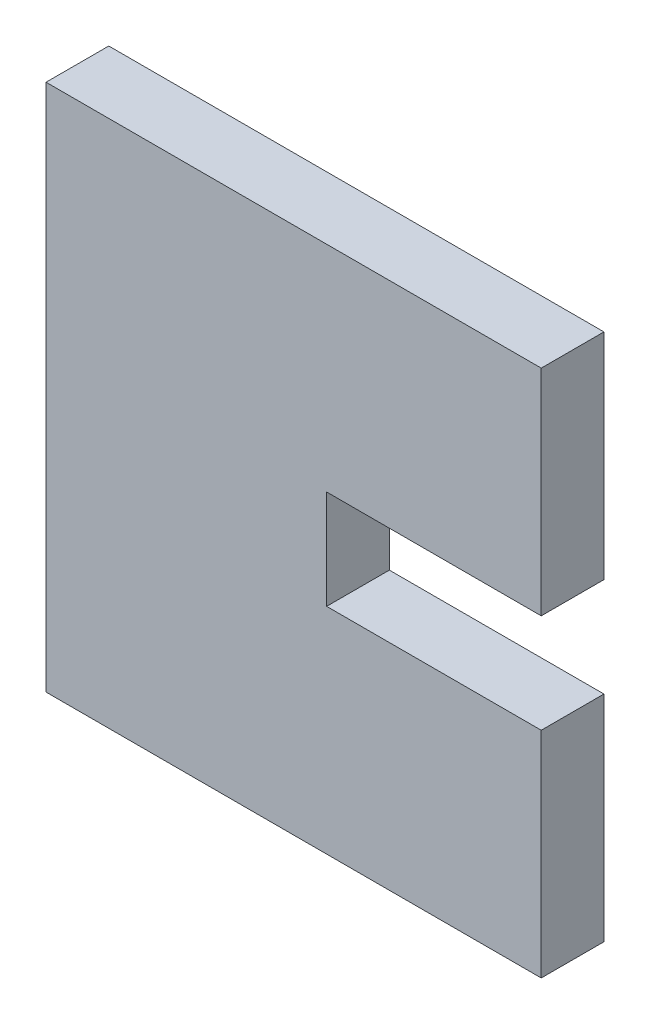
ISO-10303-21;
HEADER;
FILE_DESCRIPTION(('STEP AP214'),'2;1');
FILE_NAME('part.step','',(''),(''),'','','');
FILE_SCHEMA(('AUTOMOTIVE_DESIGN { 1 0 10303 214 1 1 1 1 }'));
ENDSEC;
DATA;
#1=APPLICATION_CONTEXT('core data for automotive mechanical design processes');
#2=APPLICATION_PROTOCOL_DEFINITION('international standard','automotive_design',2000,#1);
#3=PRODUCT_CONTEXT('',#1,'mechanical');
#4=PRODUCT('Part','Part','',(#3));
#5=PRODUCT_RELATED_PRODUCT_CATEGORY('part','',(#4));
#6=PRODUCT_DEFINITION_FORMATION('','',#4);
#7=PRODUCT_DEFINITION_CONTEXT('part definition',#1,'design');
#8=PRODUCT_DEFINITION('design','',#6,#7);
#9=PRODUCT_DEFINITION_SHAPE('','',#8);
#10=(LENGTH_UNIT() NAMED_UNIT(*) SI_UNIT(.MILLI.,.METRE.));
#11=(NAMED_UNIT(*) PLANE_ANGLE_UNIT() SI_UNIT($,.RADIAN.));
#12=(NAMED_UNIT(*) SI_UNIT($,.STERADIAN.) SOLID_ANGLE_UNIT());
#13=UNCERTAINTY_MEASURE_WITH_UNIT(LENGTH_MEASURE(1.E-05),#10,'distance_accuracy_value','');
#14=(GEOMETRIC_REPRESENTATION_CONTEXT(3) GLOBAL_UNCERTAINTY_ASSIGNED_CONTEXT((#13)) GLOBAL_UNIT_ASSIGNED_CONTEXT((#10,
#11,#12)) REPRESENTATION_CONTEXT('',''));
#15=CARTESIAN_POINT('',(0.,0.,0.));
#16=DIRECTION('',(0.,0.,1.));
#17=DIRECTION('',(1.,0.,0.));
#18=AXIS2_PLACEMENT_3D('',#15,#16,#17);
#19=CARTESIAN_POINT('',(-32.,16.,4.));
#20=DIRECTION('',(0.,1.,0.));
#21=DIRECTION('',(0.,0.,1.));
#22=AXIS2_PLACEMENT_3D('',#19,#20,#21);
#23=PLANE('',#22);
#24=DIRECTION('',(0.,0.,-1.));
#25=VECTOR('',#24,1.);
#26=CARTESIAN_POINT('',(-2.,16.,4.));
#27=LINE('',#26,#25);
#28=CARTESIAN_POINT('',(-2.,16.,4.));
#29=VERTEX_POINT('',#28);
#30=CARTESIAN_POINT('',(-2.,16.,0.200000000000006));
#31=VERTEX_POINT('',#30);
#32=EDGE_CURVE('E130',#29,#31,#27,.T.);
#33=ORIENTED_EDGE('',*,*,#32,.T.);
#34=DIRECTION('',(-1.,0.,0.));
#35=VECTOR('',#34,1.);
#36=CARTESIAN_POINT('',(-32.,16.,0.200000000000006));
#37=LINE('',#36,#35);
#38=CARTESIAN_POINT('',(-32.,16.,0.200000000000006));
#39=VERTEX_POINT('',#38);
#40=EDGE_CURVE('E11',#31,#39,#37,.T.);
#41=ORIENTED_EDGE('',*,*,#40,.T.);
#42=DIRECTION('',(0.,0.,-1.));
#43=VECTOR('',#42,1.);
#44=CARTESIAN_POINT('',(-32.,16.,4.));
#45=LINE('',#44,#43);
#46=CARTESIAN_POINT('',(-32.,16.,4.));
#47=VERTEX_POINT('',#46);
#48=EDGE_CURVE('E152',#47,#39,#45,.T.);
#49=ORIENTED_EDGE('',*,*,#48,.F.);
#50=DIRECTION('',(1.,0.,0.));
#51=VECTOR('',#50,1.);
#52=CARTESIAN_POINT('',(-32.,16.,4.));
#53=LINE('',#52,#51);
#54=EDGE_CURVE('E145',#47,#29,#53,.T.);
#55=ORIENTED_EDGE('',*,*,#54,.T.);
#56=EDGE_LOOP('',(#33,#41,#49,#55));
#57=FACE_BOUND('',#56,.T.);
#58=ADVANCED_FACE('F41',(#57),#23,.T.);
#59=CARTESIAN_POINT('',(-32.,-16.,4.));
#60=DIRECTION('',(-1.,0.,0.));
#61=DIRECTION('',(0.,0.,1.));
#62=AXIS2_PLACEMENT_3D('',#59,#60,#61);
#63=PLANE('',#62);
#64=ORIENTED_EDGE('',*,*,#48,.T.);
#65=DIRECTION('',(0.,-1.,0.));
#66=VECTOR('',#65,1.);
#67=CARTESIAN_POINT('',(-32.,-16.,0.200000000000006));
#68=LINE('',#67,#66);
#69=CARTESIAN_POINT('',(-32.,-16.,0.200000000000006));
#70=VERTEX_POINT('',#69);
#71=EDGE_CURVE('E201',#39,#70,#68,.T.);
#72=ORIENTED_EDGE('',*,*,#71,.T.);
#73=DIRECTION('',(0.,0.,-1.));
#74=VECTOR('',#73,1.);
#75=CARTESIAN_POINT('',(-32.,-16.,4.));
#76=LINE('',#75,#74);
#77=CARTESIAN_POINT('',(-32.,-16.,4.));
#78=VERTEX_POINT('',#77);
#79=EDGE_CURVE('E170',#78,#70,#76,.T.);
#80=ORIENTED_EDGE('',*,*,#79,.F.);
#81=DIRECTION('',(0.,1.,0.));
#82=VECTOR('',#81,1.);
#83=CARTESIAN_POINT('',(-32.,-16.,4.));
#84=LINE('',#83,#82);
#85=EDGE_CURVE('E138',#78,#47,#84,.T.);
#86=ORIENTED_EDGE('',*,*,#85,.T.);
#87=EDGE_LOOP('',(#64,#72,#80,#86));
#88=FACE_BOUND('',#87,.T.);
#89=ADVANCED_FACE('F253',(#88),#63,.T.);
#90=CARTESIAN_POINT('',(-32.,-16.,4.));
#91=DIRECTION('',(0.,1.,0.));
#92=DIRECTION('',(0.,0.,1.));
#93=AXIS2_PLACEMENT_3D('',#90,#91,#92);
#94=PLANE('',#93);
#95=ORIENTED_EDGE('',*,*,#79,.T.);
#96=DIRECTION('',(1.,0.,0.));
#97=VECTOR('',#96,1.);
#98=CARTESIAN_POINT('',(-2.,-16.,0.200000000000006));
#99=LINE('',#98,#97);
#100=CARTESIAN_POINT('',(-2.,-16.,0.200000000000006));
#101=VERTEX_POINT('',#100);
#102=EDGE_CURVE('E204',#70,#101,#99,.T.);
#103=ORIENTED_EDGE('',*,*,#102,.T.);
#104=DIRECTION('',(0.,0.,-1.));
#105=VECTOR('',#104,1.);
#106=CARTESIAN_POINT('',(-2.,-16.,4.));
#107=LINE('',#106,#105);
#108=CARTESIAN_POINT('',(-2.,-16.,4.));
#109=VERTEX_POINT('',#108);
#110=EDGE_CURVE('E173',#109,#101,#107,.T.);
#111=ORIENTED_EDGE('',*,*,#110,.F.);
#112=DIRECTION('',(1.,0.,0.));
#113=VECTOR('',#112,1.);
#114=CARTESIAN_POINT('',(-32.,-16.,4.));
#115=LINE('',#114,#113);
#116=EDGE_CURVE('E165',#78,#109,#115,.T.);
#117=ORIENTED_EDGE('',*,*,#116,.F.);
#118=EDGE_LOOP('',(#95,#103,#111,#117));
#119=FACE_BOUND('',#118,.T.);
#120=ADVANCED_FACE('F265',(#119),#94,.F.);
#121=CARTESIAN_POINT('',(-2.,-16.,4.));
#122=DIRECTION('',(-1.,0.,0.));
#123=DIRECTION('',(0.,-1.,0.));
#124=AXIS2_PLACEMENT_3D('',#121,#122,#123);
#125=PLANE('',#124);
#126=ORIENTED_EDGE('',*,*,#110,.T.);
#127=DIRECTION('',(0.,1.,0.));
#128=VECTOR('',#127,1.);
#129=CARTESIAN_POINT('',(-2.,-3.,0.200000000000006));
#130=LINE('',#129,#128);
#131=CARTESIAN_POINT('',(-2.,-3.,0.200000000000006));
#132=VERTEX_POINT('',#131);
#133=EDGE_CURVE('E206',#101,#132,#130,.T.);
#134=ORIENTED_EDGE('',*,*,#133,.T.);
#135=DIRECTION('',(0.,0.,-1.));
#136=VECTOR('',#135,1.);
#137=CARTESIAN_POINT('',(-2.,-3.,4.));
#138=LINE('',#137,#136);
#139=CARTESIAN_POINT('',(-2.,-3.,4.));
#140=VERTEX_POINT('',#139);
#141=EDGE_CURVE('E176',#140,#132,#138,.T.);
#142=ORIENTED_EDGE('',*,*,#141,.F.);
#143=DIRECTION('',(0.,1.,0.));
#144=VECTOR('',#143,1.);
#145=CARTESIAN_POINT('',(-2.,-16.,4.));
#146=LINE('',#145,#144);
#147=EDGE_CURVE('E163',#109,#140,#146,.T.);
#148=ORIENTED_EDGE('',*,*,#147,.F.);
#149=EDGE_LOOP('',(#126,#134,#142,#148));
#150=FACE_BOUND('',#149,.T.);
#151=ADVANCED_FACE('F270',(#150),#125,.F.);
#152=CARTESIAN_POINT('',(-2.,-3.,4.));
#153=DIRECTION('',(0.,-1.,0.));
#154=DIRECTION('',(1.,0.,0.));
#155=AXIS2_PLACEMENT_3D('',#152,#153,#154);
#156=PLANE('',#155);
#157=ORIENTED_EDGE('',*,*,#141,.T.);
#158=DIRECTION('',(-1.,0.,0.));
#159=VECTOR('',#158,1.);
#160=CARTESIAN_POINT('',(-15.,-3.,0.200000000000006));
#161=LINE('',#160,#159);
#162=CARTESIAN_POINT('',(-15.,-3.,0.200000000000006));
#163=VERTEX_POINT('',#162);
#164=EDGE_CURVE('E208',#132,#163,#161,.T.);
#165=ORIENTED_EDGE('',*,*,#164,.T.);
#166=DIRECTION('',(0.,0.,-1.));
#167=VECTOR('',#166,1.);
#168=CARTESIAN_POINT('',(-15.,-3.,4.));
#169=LINE('',#168,#167);
#170=CARTESIAN_POINT('',(-15.,-3.,4.));
#171=VERTEX_POINT('',#170);
#172=EDGE_CURVE('E179',#171,#163,#169,.T.);
#173=ORIENTED_EDGE('',*,*,#172,.F.);
#174=DIRECTION('',(-1.,0.,0.));
#175=VECTOR('',#174,1.);
#176=CARTESIAN_POINT('',(-2.,-3.,4.));
#177=LINE('',#176,#175);
#178=EDGE_CURVE('E161',#140,#171,#177,.T.);
#179=ORIENTED_EDGE('',*,*,#178,.F.);
#180=EDGE_LOOP('',(#157,#165,#173,#179));
#181=FACE_BOUND('',#180,.T.);
#182=ADVANCED_FACE('F280',(#181),#156,.F.);
#183=CARTESIAN_POINT('',(-15.,3.,4.));
#184=DIRECTION('',(1.,0.,0.));
#185=DIRECTION('',(0.,0.,-1.));
#186=AXIS2_PLACEMENT_3D('',#183,#184,#185);
#187=PLANE('',#186);
#188=ORIENTED_EDGE('',*,*,#172,.T.);
#189=DIRECTION('',(0.,1.,0.));
#190=VECTOR('',#189,1.);
#191=CARTESIAN_POINT('',(-15.,3.,0.200000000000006));
#192=LINE('',#191,#190);
#193=CARTESIAN_POINT('',(-15.,3.,0.200000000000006));
#194=VERTEX_POINT('',#193);
#195=EDGE_CURVE('E210',#163,#194,#192,.T.);
#196=ORIENTED_EDGE('',*,*,#195,.T.);
#197=DIRECTION('',(0.,0.,-1.));
#198=VECTOR('',#197,1.);
#199=CARTESIAN_POINT('',(-15.,3.,4.));
#200=LINE('',#199,#198);
#201=CARTESIAN_POINT('',(-15.,3.,4.));
#202=VERTEX_POINT('',#201);
#203=EDGE_CURVE('E182',#202,#194,#200,.T.);
#204=ORIENTED_EDGE('',*,*,#203,.F.);
#205=DIRECTION('',(0.,-1.,0.));
#206=VECTOR('',#205,1.);
#207=CARTESIAN_POINT('',(-15.,3.,4.));
#208=LINE('',#207,#206);
#209=EDGE_CURVE('E158',#202,#171,#208,.T.);
#210=ORIENTED_EDGE('',*,*,#209,.T.);
#211=EDGE_LOOP('',(#188,#196,#204,#210));
#212=FACE_BOUND('',#211,.T.);
#213=ADVANCED_FACE('F283',(#212),#187,.T.);
#214=CARTESIAN_POINT('',(-2.,3.,4.));
#215=DIRECTION('',(0.,-1.,0.));
#216=DIRECTION('',(1.,0.,0.));
#217=AXIS2_PLACEMENT_3D('',#214,#215,#216);
#218=PLANE('',#217);
#219=ORIENTED_EDGE('',*,*,#203,.T.);
#220=DIRECTION('',(1.,0.,0.));
#221=VECTOR('',#220,1.);
#222=CARTESIAN_POINT('',(-2.,3.,0.200000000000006));
#223=LINE('',#222,#221);
#224=CARTESIAN_POINT('',(-2.,3.,0.200000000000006));
#225=VERTEX_POINT('',#224);
#226=EDGE_CURVE('E66',#194,#225,#223,.T.);
#227=ORIENTED_EDGE('',*,*,#226,.T.);
#228=DIRECTION('',(0.,0.,-1.));
#229=VECTOR('',#228,1.);
#230=CARTESIAN_POINT('',(-2.,3.,4.));
#231=LINE('',#230,#229);
#232=CARTESIAN_POINT('',(-2.,3.,4.));
#233=VERTEX_POINT('',#232);
#234=EDGE_CURVE('E137',#233,#225,#231,.T.);
#235=ORIENTED_EDGE('',*,*,#234,.F.);
#236=DIRECTION('',(-1.,0.,0.));
#237=VECTOR('',#236,1.);
#238=CARTESIAN_POINT('',(-2.,3.,4.));
#239=LINE('',#238,#237);
#240=EDGE_CURVE('E149',#233,#202,#239,.T.);
#241=ORIENTED_EDGE('',*,*,#240,.T.);
#242=EDGE_LOOP('',(#219,#227,#235,#241));
#243=FACE_BOUND('',#242,.T.);
#244=ADVANCED_FACE('F284',(#243),#218,.T.);
#245=CARTESIAN_POINT('',(-2.,16.,4.));
#246=DIRECTION('',(1.,0.,0.));
#247=DIRECTION('',(0.,1.,0.));
#248=AXIS2_PLACEMENT_3D('',#245,#246,#247);
#249=PLANE('',#248);
#250=ORIENTED_EDGE('',*,*,#234,.T.);
#251=DIRECTION('',(0.,1.,0.));
#252=VECTOR('',#251,1.);
#253=CARTESIAN_POINT('',(-2.,16.,0.200000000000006));
#254=LINE('',#253,#252);
#255=EDGE_CURVE('E51',#225,#31,#254,.T.);
#256=ORIENTED_EDGE('',*,*,#255,.T.);
#257=ORIENTED_EDGE('',*,*,#32,.F.);
#258=DIRECTION('',(0.,-1.,0.));
#259=VECTOR('',#258,1.);
#260=CARTESIAN_POINT('',(-2.,16.,4.));
#261=LINE('',#260,#259);
#262=EDGE_CURVE('E133',#29,#233,#261,.T.);
#263=ORIENTED_EDGE('',*,*,#262,.T.);
#264=EDGE_LOOP('',(#250,#256,#257,#263));
#265=FACE_BOUND('',#264,.T.);
#266=ADVANCED_FACE('F132',(#265),#249,.T.);
#267=CARTESIAN_POINT('',(0.,0.,4.));
#268=DIRECTION('',(0.,0.,-1.));
#269=DIRECTION('',(-1.,0.,0.));
#270=AXIS2_PLACEMENT_3D('',#267,#268,#269);
#271=PLANE('',#270);
#272=ORIENTED_EDGE('',*,*,#54,.F.);
#273=ORIENTED_EDGE('',*,*,#85,.F.);
#274=ORIENTED_EDGE('',*,*,#116,.T.);
#275=ORIENTED_EDGE('',*,*,#147,.T.);
#276=ORIENTED_EDGE('',*,*,#178,.T.);
#277=ORIENTED_EDGE('',*,*,#209,.F.);
#278=ORIENTED_EDGE('',*,*,#240,.F.);
#279=ORIENTED_EDGE('',*,*,#262,.F.);
#280=EDGE_LOOP('',(#272,#273,#274,#275,#276,#277,#278,#279));
#281=FACE_BOUND('',#280,.T.);
#282=ADVANCED_FACE('F143',(#281),#271,.F.);
#283=CARTESIAN_POINT('',(0.,0.,0.));
#284=DIRECTION('',(0.,0.,-1.));
#285=DIRECTION('',(-1.,0.,0.));
#286=AXIS2_PLACEMENT_3D('',#283,#284,#285);
#287=PLANE('',#286);
#288=DIRECTION('',(-1.,0.,0.));
#289=VECTOR('',#288,1.);
#290=CARTESIAN_POINT('',(-32.,-15.8,0.));
#291=LINE('',#290,#289);
#292=CARTESIAN_POINT('',(-2.20000000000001,-15.8,0.));
#293=VERTEX_POINT('',#292);
#294=CARTESIAN_POINT('',(-31.8,-15.8,0.));
#295=VERTEX_POINT('',#294);
#296=EDGE_CURVE('E196',#293,#295,#291,.T.);
#297=ORIENTED_EDGE('',*,*,#296,.T.);
#298=DIRECTION('',(0.,1.,0.));
#299=VECTOR('',#298,1.);
#300=CARTESIAN_POINT('',(-31.8,0.,0.));
#301=LINE('',#300,#299);
#302=CARTESIAN_POINT('',(-31.8,15.8,0.));
#303=VERTEX_POINT('',#302);
#304=EDGE_CURVE('E198',#295,#303,#301,.T.);
#305=ORIENTED_EDGE('',*,*,#304,.T.);
#306=DIRECTION('',(1.,0.,0.));
#307=VECTOR('',#306,1.);
#308=CARTESIAN_POINT('',(0.,15.8,0.));
#309=LINE('',#308,#307);
#310=CARTESIAN_POINT('',(-2.20000000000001,15.8,0.));
#311=VERTEX_POINT('',#310);
#312=EDGE_CURVE('E169',#303,#311,#309,.T.);
#313=ORIENTED_EDGE('',*,*,#312,.T.);
#314=DIRECTION('',(0.,-1.,0.));
#315=VECTOR('',#314,1.);
#316=CARTESIAN_POINT('',(-2.20000000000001,0.,0.));
#317=LINE('',#316,#315);
#318=CARTESIAN_POINT('',(-2.20000000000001,3.20000000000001,0.));
#319=VERTEX_POINT('',#318);
#320=EDGE_CURVE('E186',#311,#319,#317,.T.);
#321=ORIENTED_EDGE('',*,*,#320,.T.);
#322=DIRECTION('',(-1.,0.,0.));
#323=VECTOR('',#322,1.);
#324=CARTESIAN_POINT('',(0.,3.20000000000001,0.));
#325=LINE('',#324,#323);
#326=CARTESIAN_POINT('',(-15.2,3.20000000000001,0.));
#327=VERTEX_POINT('',#326);
#328=EDGE_CURVE('E188',#319,#327,#325,.T.);
#329=ORIENTED_EDGE('',*,*,#328,.T.);
#330=DIRECTION('',(0.,-1.,0.));
#331=VECTOR('',#330,1.);
#332=CARTESIAN_POINT('',(-15.2,0.,0.));
#333=LINE('',#332,#331);
#334=CARTESIAN_POINT('',(-15.2,-3.20000000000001,0.));
#335=VERTEX_POINT('',#334);
#336=EDGE_CURVE('E190',#327,#335,#333,.T.);
#337=ORIENTED_EDGE('',*,*,#336,.T.);
#338=DIRECTION('',(1.,0.,0.));
#339=VECTOR('',#338,1.);
#340=CARTESIAN_POINT('',(-2.,-3.20000000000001,0.));
#341=LINE('',#340,#339);
#342=CARTESIAN_POINT('',(-2.20000000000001,-3.20000000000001,0.));
#343=VERTEX_POINT('',#342);
#344=EDGE_CURVE('E192',#335,#343,#341,.T.);
#345=ORIENTED_EDGE('',*,*,#344,.T.);
#346=DIRECTION('',(0.,-1.,0.));
#347=VECTOR('',#346,1.);
#348=CARTESIAN_POINT('',(-2.20000000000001,-16.,0.));
#349=LINE('',#348,#347);
#350=EDGE_CURVE('E194',#343,#293,#349,.T.);
#351=ORIENTED_EDGE('',*,*,#350,.T.);
#352=EDGE_LOOP('',(#297,#305,#313,#321,#329,#337,#345,#351));
#353=FACE_BOUND('',#352,.T.);
#354=ADVANCED_FACE('F241',(#353),#287,.T.);
#355=CARTESIAN_POINT('',(-15.2,0.,0.));
#356=DIRECTION('',(-0.707106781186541,0.,0.707106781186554));
#357=DIRECTION('',(0.,-1.,0.));
#358=AXIS2_PLACEMENT_3D('',#355,#356,#357);
#359=PLANE('',#358);
#360=DIRECTION('',(-0.577350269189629,0.577350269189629,-0.577350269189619));
#361=VECTOR('',#360,1.);
#362=CARTESIAN_POINT('',(-14.1333333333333,2.13333333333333,1.06666666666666));
#363=LINE('',#362,#361);
#364=EDGE_CURVE('E155',#194,#327,#363,.T.);
#365=ORIENTED_EDGE('',*,*,#364,.F.);
#366=ORIENTED_EDGE('',*,*,#195,.F.);
#367=DIRECTION('',(0.577350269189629,0.577350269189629,0.577350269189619));
#368=VECTOR('',#367,1.);
#369=CARTESIAN_POINT('',(-10.6666666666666,1.33333333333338,4.53333333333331));
#370=LINE('',#369,#368);
#371=EDGE_CURVE('E46',#335,#163,#370,.T.);
#372=ORIENTED_EDGE('',*,*,#371,.F.);
#373=ORIENTED_EDGE('',*,*,#336,.F.);
#374=EDGE_LOOP('',(#365,#366,#372,#373));
#375=FACE_BOUND('',#374,.T.);
#376=ADVANCED_FACE('F44',(#375),#359,.F.);
#377=CARTESIAN_POINT('',(-2.,-3.,0.200000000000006));
#378=DIRECTION('',(0.,0.707106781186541,-0.707106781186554));
#379=DIRECTION('',(1.,0.,0.));
#380=AXIS2_PLACEMENT_3D('',#377,#378,#379);
#381=PLANE('',#380);
#382=ORIENTED_EDGE('',*,*,#371,.T.);
#383=ORIENTED_EDGE('',*,*,#164,.F.);
#384=DIRECTION('',(-0.577350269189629,-0.577350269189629,-0.577350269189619));
#385=VECTOR('',#384,1.);
#386=CARTESIAN_POINT('',(-2.,-3.,0.200000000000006));
#387=LINE('',#386,#385);
#388=EDGE_CURVE('E227',#343,#132,#387,.F.);
#389=ORIENTED_EDGE('',*,*,#388,.F.);
#390=ORIENTED_EDGE('',*,*,#344,.F.);
#391=EDGE_LOOP('',(#382,#383,#389,#390));
#392=FACE_BOUND('',#391,.T.);
#393=ADVANCED_FACE('F277',(#392),#381,.T.);
#394=CARTESIAN_POINT('',(0.,3.20000000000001,0.));
#395=DIRECTION('',(0.,0.707106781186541,0.707106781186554));
#396=DIRECTION('',(-1.,0.,0.));
#397=AXIS2_PLACEMENT_3D('',#394,#395,#396);
#398=PLANE('',#397);
#399=ORIENTED_EDGE('',*,*,#364,.T.);
#400=ORIENTED_EDGE('',*,*,#328,.F.);
#401=DIRECTION('',(-0.577350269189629,0.577350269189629,-0.577350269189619));
#402=VECTOR('',#401,1.);
#403=CARTESIAN_POINT('',(-1.13333333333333,2.13333333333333,1.06666666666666));
#404=LINE('',#403,#402);
#405=EDGE_CURVE('E224',#225,#319,#404,.T.);
#406=ORIENTED_EDGE('',*,*,#405,.F.);
#407=ORIENTED_EDGE('',*,*,#226,.F.);
#408=EDGE_LOOP('',(#399,#400,#406,#407));
#409=FACE_BOUND('',#408,.T.);
#410=ADVANCED_FACE('F233',(#409),#398,.F.);
#411=CARTESIAN_POINT('',(-2.,-16.,0.200000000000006));
#412=DIRECTION('',(0.707106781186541,0.,-0.707106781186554));
#413=DIRECTION('',(0.,-1.,0.));
#414=AXIS2_PLACEMENT_3D('',#411,#412,#413);
#415=PLANE('',#414);
#416=ORIENTED_EDGE('',*,*,#388,.T.);
#417=ORIENTED_EDGE('',*,*,#133,.F.);
#418=DIRECTION('',(-0.577350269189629,0.577350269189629,-0.577350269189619));
#419=VECTOR('',#418,1.);
#420=CARTESIAN_POINT('',(-2.,-16.,0.200000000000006));
#421=LINE('',#420,#419);
#422=EDGE_CURVE('E221',#293,#101,#421,.F.);
#423=ORIENTED_EDGE('',*,*,#422,.F.);
#424=ORIENTED_EDGE('',*,*,#350,.F.);
#425=EDGE_LOOP('',(#416,#417,#423,#424));
#426=FACE_BOUND('',#425,.T.);
#427=ADVANCED_FACE('F273',(#426),#415,.T.);
#428=CARTESIAN_POINT('',(-2.20000000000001,0.,0.));
#429=DIRECTION('',(-0.707106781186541,0.,0.707106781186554));
#430=DIRECTION('',(0.,-1.,0.));
#431=AXIS2_PLACEMENT_3D('',#428,#429,#430);
#432=PLANE('',#431);
#433=ORIENTED_EDGE('',*,*,#405,.T.);
#434=ORIENTED_EDGE('',*,*,#320,.F.);
#435=DIRECTION('',(-0.577350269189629,-0.577350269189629,-0.577350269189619));
#436=VECTOR('',#435,1.);
#437=CARTESIAN_POINT('',(-1.46666666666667,16.5333333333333,0.733333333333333));
#438=LINE('',#437,#436);
#439=EDGE_CURVE('E218',#31,#311,#438,.T.);
#440=ORIENTED_EDGE('',*,*,#439,.F.);
#441=ORIENTED_EDGE('',*,*,#255,.F.);
#442=EDGE_LOOP('',(#433,#434,#440,#441));
#443=FACE_BOUND('',#442,.T.);
#444=ADVANCED_FACE('F246',(#443),#432,.F.);
#445=CARTESIAN_POINT('',(-32.,-16.,0.200000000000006));
#446=DIRECTION('',(0.,-0.707106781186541,-0.707106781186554));
#447=DIRECTION('',(-1.,0.,0.));
#448=AXIS2_PLACEMENT_3D('',#445,#446,#447);
#449=PLANE('',#448);
#450=ORIENTED_EDGE('',*,*,#422,.T.);
#451=ORIENTED_EDGE('',*,*,#102,.F.);
#452=DIRECTION('',(-0.577350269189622,-0.577350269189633,0.577350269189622));
#453=VECTOR('',#452,1.);
#454=CARTESIAN_POINT('',(-32.,-16.,0.200000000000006));
#455=LINE('',#454,#453);
#456=EDGE_CURVE('E216',#295,#70,#455,.T.);
#457=ORIENTED_EDGE('',*,*,#456,.F.);
#458=ORIENTED_EDGE('',*,*,#296,.F.);
#459=EDGE_LOOP('',(#450,#451,#457,#458));
#460=FACE_BOUND('',#459,.T.);
#461=ADVANCED_FACE('F261',(#460),#449,.T.);
#462=CARTESIAN_POINT('',(0.,15.8,0.));
#463=DIRECTION('',(0.,-0.707106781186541,0.707106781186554));
#464=DIRECTION('',(1.,0.,0.));
#465=AXIS2_PLACEMENT_3D('',#462,#463,#464);
#466=PLANE('',#465);
#467=ORIENTED_EDGE('',*,*,#439,.T.);
#468=ORIENTED_EDGE('',*,*,#312,.F.);
#469=DIRECTION('',(-0.577350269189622,0.577350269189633,0.577350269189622));
#470=VECTOR('',#469,1.);
#471=CARTESIAN_POINT('',(-21.2000000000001,5.19999999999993,-10.5999999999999));
#472=LINE('',#471,#470);
#473=EDGE_CURVE('E214',#39,#303,#472,.F.);
#474=ORIENTED_EDGE('',*,*,#473,.F.);
#475=ORIENTED_EDGE('',*,*,#40,.F.);
#476=EDGE_LOOP('',(#467,#468,#474,#475));
#477=FACE_BOUND('',#476,.T.);
#478=ADVANCED_FACE('F249',(#477),#466,.F.);
#479=CARTESIAN_POINT('',(-31.8,0.,0.));
#480=DIRECTION('',(0.707106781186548,0.,0.707106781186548));
#481=DIRECTION('',(0.,1.,0.));
#482=AXIS2_PLACEMENT_3D('',#479,#480,#481);
#483=PLANE('',#482);
#484=ORIENTED_EDGE('',*,*,#456,.T.);
#485=ORIENTED_EDGE('',*,*,#71,.F.);
#486=ORIENTED_EDGE('',*,*,#473,.T.);
#487=ORIENTED_EDGE('',*,*,#304,.F.);
#488=EDGE_LOOP('',(#484,#485,#486,#487));
#489=FACE_BOUND('',#488,.T.);
#490=ADVANCED_FACE('F255',(#489),#483,.F.);
#491=CLOSED_SHELL('',(#58,#89,#120,#151,#182,#213,#244,#266,#282,#354,#376,#393,#410,#427,#444,
#461,#478,#490));
#492=MANIFOLD_SOLID_BREP('B2',#491);
#493=ADVANCED_BREP_SHAPE_REPRESENTATION('',(#18,#492),#14);
#494=SHAPE_DEFINITION_REPRESENTATION(#9,#493);
ENDSEC;
END-ISO-10303-21;
